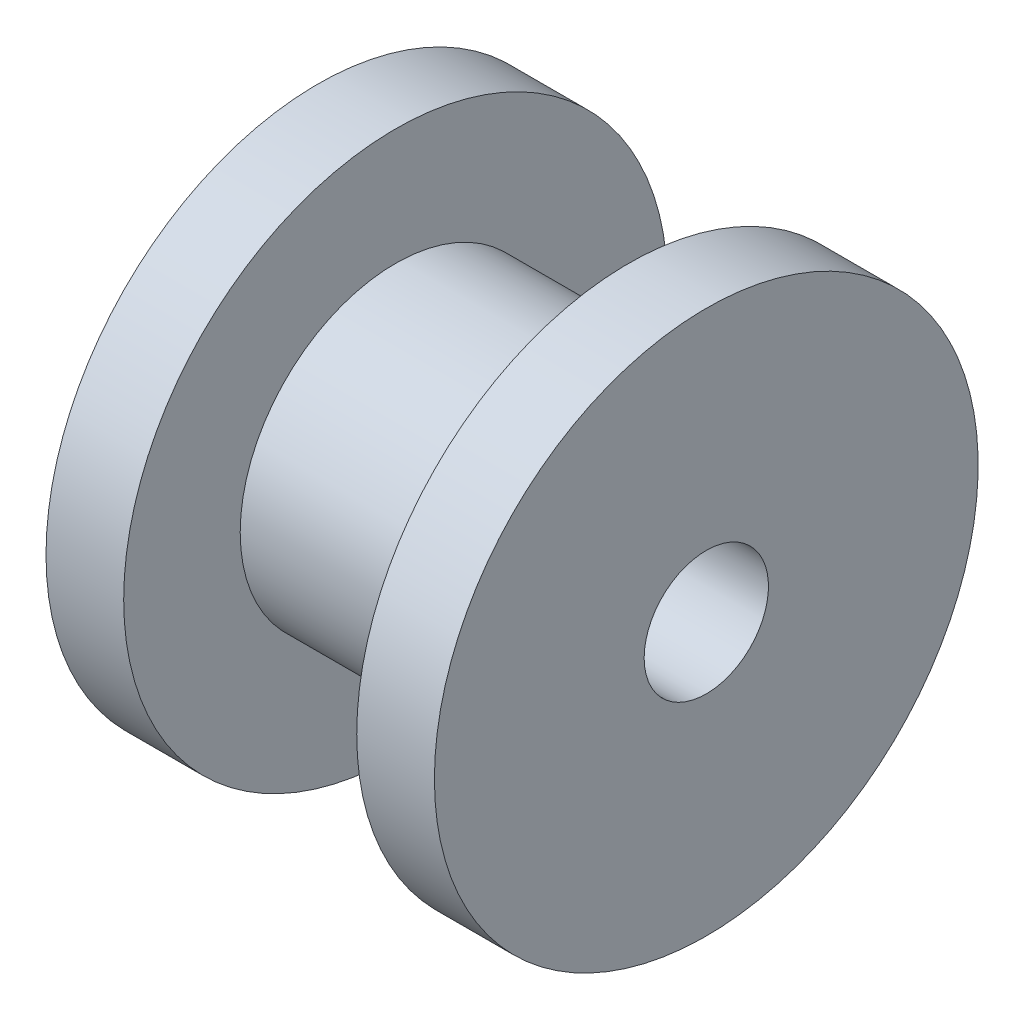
ISO-10303-21;
HEADER;
FILE_DESCRIPTION(('STEP AP214'),'2;1');
FILE_NAME('part.step','',(''),(''),'','','');
FILE_SCHEMA(('AUTOMOTIVE_DESIGN { 1 0 10303 214 1 1 1 1 }'));
ENDSEC;
DATA;
#1=APPLICATION_CONTEXT('core data for automotive mechanical design processes');
#2=APPLICATION_PROTOCOL_DEFINITION('international standard','automotive_design',2000,#1);
#3=PRODUCT_CONTEXT('',#1,'mechanical');
#4=PRODUCT('Part','Part','',(#3));
#5=PRODUCT_RELATED_PRODUCT_CATEGORY('part','',(#4));
#6=PRODUCT_DEFINITION_FORMATION('','',#4);
#7=PRODUCT_DEFINITION_CONTEXT('part definition',#1,'design');
#8=PRODUCT_DEFINITION('design','',#6,#7);
#9=PRODUCT_DEFINITION_SHAPE('','',#8);
#10=(LENGTH_UNIT() NAMED_UNIT(*) SI_UNIT(.MILLI.,.METRE.));
#11=(NAMED_UNIT(*) PLANE_ANGLE_UNIT() SI_UNIT($,.RADIAN.));
#12=(NAMED_UNIT(*) SI_UNIT($,.STERADIAN.) SOLID_ANGLE_UNIT());
#13=UNCERTAINTY_MEASURE_WITH_UNIT(LENGTH_MEASURE(1.E-05),#10,'distance_accuracy_value','');
#14=(GEOMETRIC_REPRESENTATION_CONTEXT(3) GLOBAL_UNCERTAINTY_ASSIGNED_CONTEXT((#13)) GLOBAL_UNIT_ASSIGNED_CONTEXT((#10,
#11,#12)) REPRESENTATION_CONTEXT('',''));
#15=CARTESIAN_POINT('',(0.,0.,0.));
#16=DIRECTION('',(0.,0.,1.));
#17=DIRECTION('',(1.,0.,0.));
#18=AXIS2_PLACEMENT_3D('',#15,#16,#17);
#19=CARTESIAN_POINT('',(2.,0.,-7.));
#20=DIRECTION('',(-1.,0.,0.));
#21=DIRECTION('',(0.,0.,1.));
#22=AXIS2_PLACEMENT_3D('',#19,#20,#21);
#23=PLANE('',#22);
#24=CARTESIAN_POINT('',(2.,0.,0.));
#25=DIRECTION('',(-1.,0.,0.));
#26=DIRECTION('',(0.,0.,1.));
#27=AXIS2_PLACEMENT_3D('',#24,#25,#26);
#28=CIRCLE('',#27,4.);
#29=CARTESIAN_POINT('',(2.,0.,4.));
#30=VERTEX_POINT('',#29);
#31=EDGE_CURVE('E18',#30,#30,#28,.F.);
#32=ORIENTED_EDGE('',*,*,#31,.F.);
#33=EDGE_LOOP('',(#32));
#34=FACE_BOUND('',#33,.T.);
#35=CARTESIAN_POINT('',(2.,0.,0.));
#36=DIRECTION('',(-1.,0.,0.));
#37=DIRECTION('',(0.,0.,1.));
#38=AXIS2_PLACEMENT_3D('',#35,#36,#37);
#39=CIRCLE('',#38,7.);
#40=CARTESIAN_POINT('',(2.,0.,7.));
#41=VERTEX_POINT('',#40);
#42=EDGE_CURVE('E40',#41,#41,#39,.T.);
#43=ORIENTED_EDGE('',*,*,#42,.F.);
#44=EDGE_LOOP('',(#43));
#45=FACE_BOUND('',#44,.T.);
#46=ADVANCED_FACE('F15',(#34,#45),#23,.F.);
#47=CARTESIAN_POINT('',(0.,0.,0.));
#48=DIRECTION('',(-1.,0.,0.));
#49=DIRECTION('',(0.,0.,1.));
#50=AXIS2_PLACEMENT_3D('',#47,#48,#49);
#51=CYLINDRICAL_SURFACE('',#50,4.);
#52=ORIENTED_EDGE('',*,*,#31,.T.);
#53=EDGE_LOOP('',(#52));
#54=FACE_BOUND('',#53,.T.);
#55=CARTESIAN_POINT('',(8.,0.,0.));
#56=DIRECTION('',(-1.,0.,0.));
#57=DIRECTION('',(0.,0.,1.));
#58=AXIS2_PLACEMENT_3D('',#55,#56,#57);
#59=CIRCLE('',#58,4.);
#60=CARTESIAN_POINT('',(8.,0.,4.));
#61=VERTEX_POINT('',#60);
#62=EDGE_CURVE('E38',#61,#61,#59,.T.);
#63=ORIENTED_EDGE('',*,*,#62,.T.);
#64=EDGE_LOOP('',(#63));
#65=FACE_BOUND('',#64,.T.);
#66=ADVANCED_FACE('F47',(#54,#65),#51,.T.);
#67=CARTESIAN_POINT('',(0.,0.,0.));
#68=DIRECTION('',(-1.,0.,0.));
#69=DIRECTION('',(0.,0.,1.));
#70=AXIS2_PLACEMENT_3D('',#67,#68,#69);
#71=CYLINDRICAL_SURFACE('',#70,7.);
#72=CARTESIAN_POINT('',(0.,0.,0.));
#73=DIRECTION('',(-1.,0.,0.));
#74=DIRECTION('',(0.,0.,1.));
#75=AXIS2_PLACEMENT_3D('',#72,#73,#74);
#76=CIRCLE('',#75,7.);
#77=CARTESIAN_POINT('',(0.,0.,7.));
#78=VERTEX_POINT('',#77);
#79=EDGE_CURVE('E35',#78,#78,#76,.F.);
#80=ORIENTED_EDGE('',*,*,#79,.T.);
#81=EDGE_LOOP('',(#80));
#82=FACE_BOUND('',#81,.T.);
#83=ORIENTED_EDGE('',*,*,#42,.T.);
#84=EDGE_LOOP('',(#83));
#85=FACE_BOUND('',#84,.T.);
#86=ADVANCED_FACE('F56',(#82,#85),#71,.T.);
#87=CARTESIAN_POINT('',(8.,0.,-4.));
#88=DIRECTION('',(1.,0.,0.));
#89=DIRECTION('',(0.,0.,-1.));
#90=AXIS2_PLACEMENT_3D('',#87,#88,#89);
#91=PLANE('',#90);
#92=CARTESIAN_POINT('',(8.,0.,0.));
#93=DIRECTION('',(-1.,0.,0.));
#94=DIRECTION('',(0.,0.,1.));
#95=AXIS2_PLACEMENT_3D('',#92,#93,#94);
#96=CIRCLE('',#95,7.);
#97=CARTESIAN_POINT('',(8.,0.,7.));
#98=VERTEX_POINT('',#97);
#99=EDGE_CURVE('E32',#98,#98,#96,.F.);
#100=ORIENTED_EDGE('',*,*,#99,.F.);
#101=EDGE_LOOP('',(#100));
#102=FACE_BOUND('',#101,.T.);
#103=ORIENTED_EDGE('',*,*,#62,.F.);
#104=EDGE_LOOP('',(#103));
#105=FACE_BOUND('',#104,.T.);
#106=ADVANCED_FACE('F75',(#102,#105),#91,.F.);
#107=CARTESIAN_POINT('',(0.,0.,-1.6));
#108=DIRECTION('',(1.,0.,0.));
#109=DIRECTION('',(0.,0.,-1.));
#110=AXIS2_PLACEMENT_3D('',#107,#108,#109);
#111=PLANE('',#110);
#112=ORIENTED_EDGE('',*,*,#79,.F.);
#113=EDGE_LOOP('',(#112));
#114=FACE_BOUND('',#113,.T.);
#115=CARTESIAN_POINT('',(0.,0.,0.));
#116=DIRECTION('',(-1.,0.,0.));
#117=DIRECTION('',(0.,0.,1.));
#118=AXIS2_PLACEMENT_3D('',#115,#116,#117);
#119=CIRCLE('',#118,1.6);
#120=CARTESIAN_POINT('',(0.,0.,1.6));
#121=VERTEX_POINT('',#120);
#122=EDGE_CURVE('E27',#121,#121,#119,.F.);
#123=ORIENTED_EDGE('',*,*,#122,.T.);
#124=EDGE_LOOP('',(#123));
#125=FACE_BOUND('',#124,.T.);
#126=ADVANCED_FACE('F71',(#114,#125),#111,.F.);
#127=CARTESIAN_POINT('',(0.,0.,0.));
#128=DIRECTION('',(-1.,0.,0.));
#129=DIRECTION('',(0.,0.,1.));
#130=AXIS2_PLACEMENT_3D('',#127,#128,#129);
#131=CYLINDRICAL_SURFACE('',#130,7.);
#132=ORIENTED_EDGE('',*,*,#99,.T.);
#133=EDGE_LOOP('',(#132));
#134=FACE_BOUND('',#133,.T.);
#135=CARTESIAN_POINT('',(10.,0.,0.));
#136=DIRECTION('',(-1.,0.,0.));
#137=DIRECTION('',(0.,0.,1.));
#138=AXIS2_PLACEMENT_3D('',#135,#136,#137);
#139=CIRCLE('',#138,7.);
#140=CARTESIAN_POINT('',(10.,0.,7.));
#141=VERTEX_POINT('',#140);
#142=EDGE_CURVE('E22',#141,#141,#139,.T.);
#143=ORIENTED_EDGE('',*,*,#142,.T.);
#144=EDGE_LOOP('',(#143));
#145=FACE_BOUND('',#144,.T.);
#146=ADVANCED_FACE('F65',(#134,#145),#131,.T.);
#147=CARTESIAN_POINT('',(0.,0.,0.));
#148=DIRECTION('',(-1.,0.,0.));
#149=DIRECTION('',(0.,0.,1.));
#150=AXIS2_PLACEMENT_3D('',#147,#148,#149);
#151=CYLINDRICAL_SURFACE('',#150,1.6);
#152=CARTESIAN_POINT('',(10.,0.,0.));
#153=DIRECTION('',(-1.,0.,0.));
#154=DIRECTION('',(0.,0.,1.));
#155=AXIS2_PLACEMENT_3D('',#152,#153,#154);
#156=CIRCLE('',#155,1.6);
#157=CARTESIAN_POINT('',(10.,0.,1.6));
#158=VERTEX_POINT('',#157);
#159=EDGE_CURVE('E10',#158,#158,#156,.F.);
#160=ORIENTED_EDGE('',*,*,#159,.T.);
#161=EDGE_LOOP('',(#160));
#162=FACE_BOUND('',#161,.T.);
#163=ORIENTED_EDGE('',*,*,#122,.F.);
#164=EDGE_LOOP('',(#163));
#165=FACE_BOUND('',#164,.T.);
#166=ADVANCED_FACE('F59',(#162,#165),#151,.F.);
#167=CARTESIAN_POINT('',(10.,0.,-7.));
#168=DIRECTION('',(-1.,0.,0.));
#169=DIRECTION('',(0.,0.,1.));
#170=AXIS2_PLACEMENT_3D('',#167,#168,#169);
#171=PLANE('',#170);
#172=ORIENTED_EDGE('',*,*,#159,.F.);
#173=EDGE_LOOP('',(#172));
#174=FACE_BOUND('',#173,.T.);
#175=ORIENTED_EDGE('',*,*,#142,.F.);
#176=EDGE_LOOP('',(#175));
#177=FACE_BOUND('',#176,.T.);
#178=ADVANCED_FACE('F57',(#174,#177),#171,.F.);
#179=CLOSED_SHELL('',(#46,#66,#86,#106,#126,#146,#166,#178));
#180=MANIFOLD_SOLID_BREP('B1',#179);
#181=ADVANCED_BREP_SHAPE_REPRESENTATION('',(#18,#180),#14);
#182=SHAPE_DEFINITION_REPRESENTATION(#9,#181);
ENDSEC;
END-ISO-10303-21;
